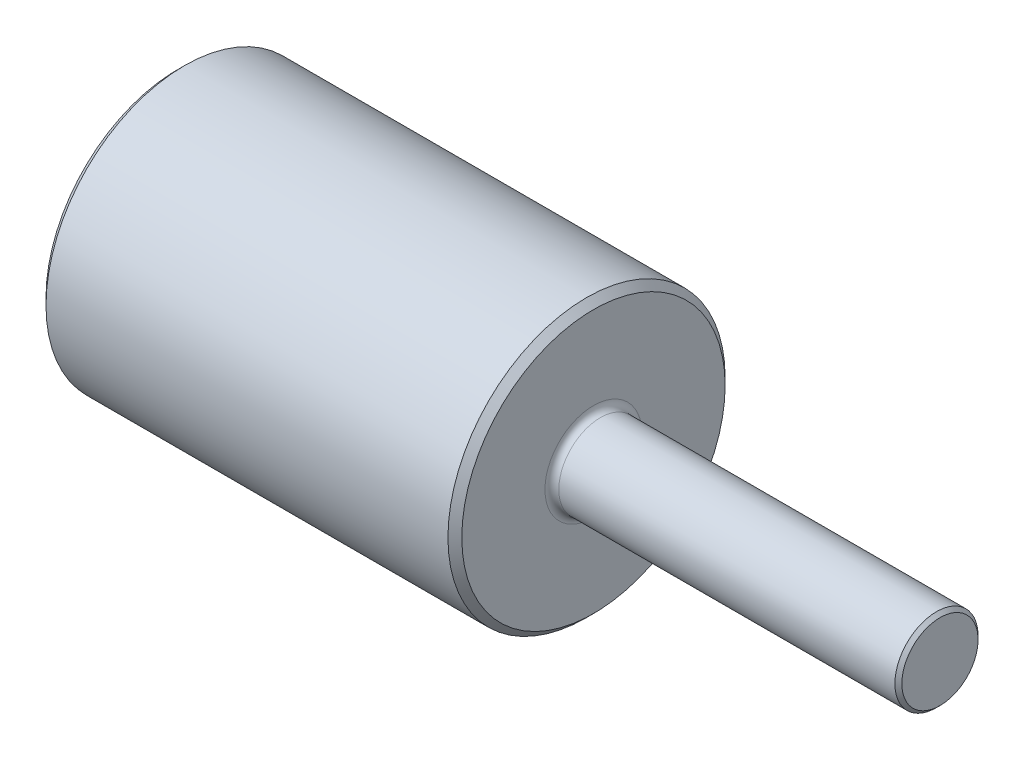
from build123d import *

# Parameters (mm, degrees)
CHANFREIN1_SIZE = 0.25
CHANFREIN3_SIZE = 0.5
CONG_1_R        = 0.5


with BuildPart() as part:
    # Esquisse1 → Base-R_volution (revolve)
    with BuildSketch(Plane.XY, mode=Mode.PRIVATE) as base_r_volution_sk:
        Polygon((0, 0), (0, 3), (-25, 3), (-25, 10), (-55, 10), (-55, 0), align=None)
    revolve(base_r_volution_sk.sketch.rotate(Axis((-58.669915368, 0, 0), (1, 0, 0)), 90), axis=Axis((-58.669915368, 0, 0), (1, 0, 0)))

    # Chanfrein1
    chanfrein1_edges = [part.edges().sort_by_distance(p)[0] for p in [
        (0, 0, -3),
    ]]
    chamfer(chanfrein1_edges, length=CHANFREIN1_SIZE)

    # Chanfrein3
    chanfrein3_edges = [part.edges().sort_by_distance(p)[0] for p in [
        (-55, 0, -10),
        (-25, 0, -10),
    ]]
    chamfer(chanfrein3_edges, length=CHANFREIN3_SIZE)

    # Cong_1
    cong_1_edges = [part.edges().sort_by_distance(p)[0] for p in [
        (-25, 0, -3),
    ]]
    fillet(cong_1_edges, radius=CONG_1_R)


solid = part.part
